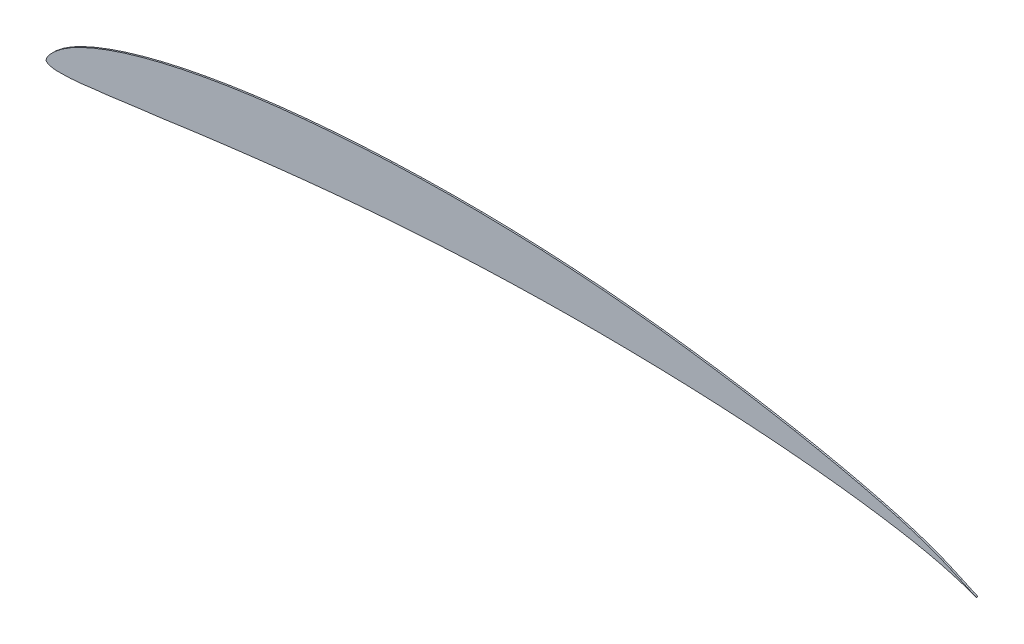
from build123d import *

# Parameters (mm, degrees)
LINEAR_AUSTRAGEN1_DEPTH = 0.125


with BuildPart() as part:
    # Skizze1 → Linear austragen1 (new, symmetric)
    with BuildSketch(Plane.XY):
        Polygon((-150, 0), (-149.8395, 0.51), (-149.358, 1.1445), (-148.5585, 1.9545), (-147.444, 2.8305), (-146.0205, 3.744), (-144.291, 4.644), (-142.266, 5.55), (-139.9515, 6.4455), (-137.3595, 7.3155), (-134.502, 8.1555), (-131.388, 8.955), (-128.0325, 9.7095), (-124.4505, 10.4115), (-120.657, 11.0565), (-116.6685, 11.6415), (-112.5, 12.1605), (-108.171, 12.6105), (-103.701, 12.99), (-99.108, 13.2945), (-94.4115, 13.524), (-89.6325, 13.674), (-84.789, 13.746), (-79.905, 13.737), (-75, 13.6425), (-70.095, 13.4625), (-65.211, 13.194), (-60.3675, 12.84), (-55.5885, 12.405), (-50.892, 11.8995), (-46.299, 11.3295), (-41.829, 10.7085), (-37.5, 10.047), (-33.3315, 9.3525), (-29.343, 8.6295), (-25.5495, 7.887), (-21.9675, 7.131), (-18.612, 6.366), (-15.498, 5.5995), (-12.6405, 4.836), (-10.0485, 4.0725), (-7.734, 3.3015), (-5.709, 2.532), (-3.9795, 1.797), (-2.556, 1.1505), (-1.4415, 0.636), (-0.642, 0.2745), (-0.1605, 0.0675), (0, 0), (-0.1605, 0.0555), (-0.642, 0.2235), (-1.4415, 0.495), (-2.556, 0.858), (-3.9795, 1.2855), (-5.709, 1.752), (-7.734, 2.2305), (-10.0485, 2.7075), (-12.6405, 3.1755), (-15.498, 3.6285), (-18.612, 4.0665), (-21.9675, 4.4835), (-25.5495, 4.875), (-29.343, 5.232), (-33.3315, 5.5545), (-37.5, 5.838), (-41.829, 6.0795), (-46.299, 6.273), (-50.892, 6.4215), (-55.5885, 6.519), (-60.3675, 6.564), (-65.211, 6.5565), (-70.095, 6.495), (-75, 6.3795), (-79.905, 6.21), (-84.789, 5.9835), (-89.6325, 5.7015), (-94.4115, 5.367), (-99.108, 4.986), (-103.701, 4.5675), (-108.171, 4.119), (-112.5, 3.6495), (-116.6685, 3.1635), (-120.657, 2.673), (-124.4505, 2.1915), (-128.0325, 1.7055), (-131.388, 1.2285), (-134.502, 0.8415), (-137.3595, 0.462), (-139.9515, 0.105), (-142.266, -0.15), (-144.291, -0.405), (-146.0205, -0.555), (-147.444, -0.6), (-148.5585, -0.6), (-149.358, -0.45), (-149.8395, -0.225), align=None)
    extrude(amount=LINEAR_AUSTRAGEN1_DEPTH, both=True)


solid = part.part
